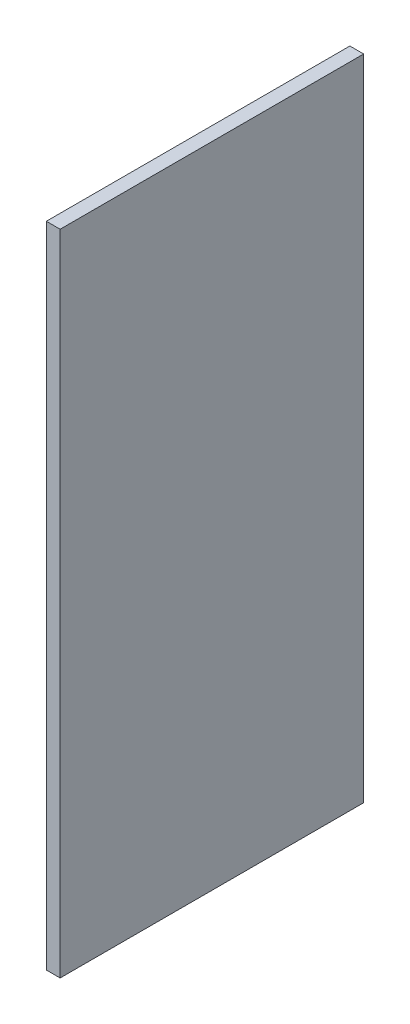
ISO-10303-21;
HEADER;
FILE_DESCRIPTION(('STEP AP214'),'2;1');
FILE_NAME('part.step','',(''),(''),'','','');
FILE_SCHEMA(('AUTOMOTIVE_DESIGN { 1 0 10303 214 1 1 1 1 }'));
ENDSEC;
DATA;
#1=APPLICATION_CONTEXT('core data for automotive mechanical design processes');
#2=APPLICATION_PROTOCOL_DEFINITION('international standard','automotive_design',2000,#1);
#3=PRODUCT_CONTEXT('',#1,'mechanical');
#4=PRODUCT('Part','Part','',(#3));
#5=PRODUCT_RELATED_PRODUCT_CATEGORY('part','',(#4));
#6=PRODUCT_DEFINITION_FORMATION('','',#4);
#7=PRODUCT_DEFINITION_CONTEXT('part definition',#1,'design');
#8=PRODUCT_DEFINITION('design','',#6,#7);
#9=PRODUCT_DEFINITION_SHAPE('','',#8);
#10=(LENGTH_UNIT() NAMED_UNIT(*) SI_UNIT(.MILLI.,.METRE.));
#11=(NAMED_UNIT(*) PLANE_ANGLE_UNIT() SI_UNIT($,.RADIAN.));
#12=(NAMED_UNIT(*) SI_UNIT($,.STERADIAN.) SOLID_ANGLE_UNIT());
#13=UNCERTAINTY_MEASURE_WITH_UNIT(LENGTH_MEASURE(1.E-05),#10,'distance_accuracy_value','');
#14=(GEOMETRIC_REPRESENTATION_CONTEXT(3) GLOBAL_UNCERTAINTY_ASSIGNED_CONTEXT((#13)) GLOBAL_UNIT_ASSIGNED_CONTEXT((#10,
#11,#12)) REPRESENTATION_CONTEXT('',''));
#15=CARTESIAN_POINT('',(0.,0.,0.));
#16=DIRECTION('',(0.,0.,1.));
#17=DIRECTION('',(1.,0.,0.));
#18=AXIS2_PLACEMENT_3D('',#15,#16,#17);
#19=CARTESIAN_POINT('',(-31.7831881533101,63.5663763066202,110.));
#20=DIRECTION('',(1.,0.,0.));
#21=DIRECTION('',(0.,1.,0.));
#22=AXIS2_PLACEMENT_3D('',#19,#20,#21);
#23=PLANE('',#22);
#24=DIRECTION('',(0.,-1.,0.));
#25=VECTOR('',#24,1.);
#26=CARTESIAN_POINT('',(-31.7831881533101,63.5663763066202,0.));
#27=LINE('',#26,#25);
#28=CARTESIAN_POINT('',(-31.7831881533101,63.5663763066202,0.));
#29=VERTEX_POINT('',#28);
#30=CARTESIAN_POINT('',(-31.7831881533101,-171.43362369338,0.));
#31=VERTEX_POINT('',#30);
#32=EDGE_CURVE('E79',#29,#31,#27,.T.);
#33=ORIENTED_EDGE('',*,*,#32,.T.);
#34=DIRECTION('',(0.,0.,-1.));
#35=VECTOR('',#34,1.);
#36=CARTESIAN_POINT('',(-31.7831881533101,-171.43362369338,110.));
#37=LINE('',#36,#35);
#38=CARTESIAN_POINT('',(-31.7831881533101,-171.43362369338,110.));
#39=VERTEX_POINT('',#38);
#40=EDGE_CURVE('E11',#39,#31,#37,.T.);
#41=ORIENTED_EDGE('',*,*,#40,.F.);
#42=DIRECTION('',(0.,-1.,0.));
#43=VECTOR('',#42,1.);
#44=CARTESIAN_POINT('',(-31.7831881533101,63.5663763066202,110.));
#45=LINE('',#44,#43);
#46=CARTESIAN_POINT('',(-31.7831881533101,63.5663763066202,110.));
#47=VERTEX_POINT('',#46);
#48=EDGE_CURVE('E97',#47,#39,#45,.T.);
#49=ORIENTED_EDGE('',*,*,#48,.F.);
#50=DIRECTION('',(0.,0.,-1.));
#51=VECTOR('',#50,1.);
#52=CARTESIAN_POINT('',(-31.7831881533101,63.5663763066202,110.));
#53=LINE('',#52,#51);
#54=EDGE_CURVE('E91',#47,#29,#53,.T.);
#55=ORIENTED_EDGE('',*,*,#54,.T.);
#56=EDGE_LOOP('',(#33,#41,#49,#55));
#57=FACE_BOUND('',#56,.T.);
#58=ADVANCED_FACE('F35',(#57),#23,.F.);
#59=CARTESIAN_POINT('',(-31.7831881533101,-171.43362369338,110.));
#60=DIRECTION('',(0.,1.,0.));
#61=DIRECTION('',(0.,0.,1.));
#62=AXIS2_PLACEMENT_3D('',#59,#60,#61);
#63=PLANE('',#62);
#64=DIRECTION('',(1.,0.,0.));
#65=VECTOR('',#64,1.);
#66=CARTESIAN_POINT('',(-31.7831881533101,-171.43362369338,0.));
#67=LINE('',#66,#65);
#68=CARTESIAN_POINT('',(-26.7831881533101,-171.43362369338,0.));
#69=VERTEX_POINT('',#68);
#70=EDGE_CURVE('E75',#31,#69,#67,.T.);
#71=ORIENTED_EDGE('',*,*,#70,.T.);
#72=DIRECTION('',(0.,0.,-1.));
#73=VECTOR('',#72,1.);
#74=CARTESIAN_POINT('',(-26.7831881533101,-171.43362369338,110.));
#75=LINE('',#74,#73);
#76=CARTESIAN_POINT('',(-26.7831881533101,-171.43362369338,110.));
#77=VERTEX_POINT('',#76);
#78=EDGE_CURVE('E42',#77,#69,#75,.T.);
#79=ORIENTED_EDGE('',*,*,#78,.F.);
#80=DIRECTION('',(1.,0.,0.));
#81=VECTOR('',#80,1.);
#82=CARTESIAN_POINT('',(-31.7831881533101,-171.43362369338,110.));
#83=LINE('',#82,#81);
#84=EDGE_CURVE('E87',#39,#77,#83,.T.);
#85=ORIENTED_EDGE('',*,*,#84,.F.);
#86=ORIENTED_EDGE('',*,*,#40,.T.);
#87=EDGE_LOOP('',(#71,#79,#85,#86));
#88=FACE_BOUND('',#87,.T.);
#89=ADVANCED_FACE('F86',(#88),#63,.F.);
#90=CARTESIAN_POINT('',(-26.7831881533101,63.5663763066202,110.));
#91=DIRECTION('',(-1.,0.,0.));
#92=DIRECTION('',(0.,-1.,0.));
#93=AXIS2_PLACEMENT_3D('',#90,#91,#92);
#94=PLANE('',#93);
#95=DIRECTION('',(0.,1.,0.));
#96=VECTOR('',#95,1.);
#97=CARTESIAN_POINT('',(-26.7831881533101,63.5663763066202,0.));
#98=LINE('',#97,#96);
#99=CARTESIAN_POINT('',(-26.7831881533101,63.5663763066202,0.));
#100=VERTEX_POINT('',#99);
#101=EDGE_CURVE('E80',#69,#100,#98,.T.);
#102=ORIENTED_EDGE('',*,*,#101,.T.);
#103=DIRECTION('',(0.,0.,-1.));
#104=VECTOR('',#103,1.);
#105=CARTESIAN_POINT('',(-26.7831881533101,63.5663763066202,110.));
#106=LINE('',#105,#104);
#107=CARTESIAN_POINT('',(-26.7831881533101,63.5663763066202,110.));
#108=VERTEX_POINT('',#107);
#109=EDGE_CURVE('E103',#108,#100,#106,.T.);
#110=ORIENTED_EDGE('',*,*,#109,.F.);
#111=DIRECTION('',(0.,1.,0.));
#112=VECTOR('',#111,1.);
#113=CARTESIAN_POINT('',(-26.7831881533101,63.5663763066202,110.));
#114=LINE('',#113,#112);
#115=EDGE_CURVE('E54',#77,#108,#114,.T.);
#116=ORIENTED_EDGE('',*,*,#115,.F.);
#117=ORIENTED_EDGE('',*,*,#78,.T.);
#118=EDGE_LOOP('',(#102,#110,#116,#117));
#119=FACE_BOUND('',#118,.T.);
#120=ADVANCED_FACE('F106',(#119),#94,.F.);
#121=CARTESIAN_POINT('',(-31.7831881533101,63.5663763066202,110.));
#122=DIRECTION('',(0.,-1.,0.));
#123=DIRECTION('',(0.,0.,-1.));
#124=AXIS2_PLACEMENT_3D('',#121,#122,#123);
#125=PLANE('',#124);
#126=DIRECTION('',(-1.,0.,0.));
#127=VECTOR('',#126,1.);
#128=CARTESIAN_POINT('',(-31.7831881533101,63.5663763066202,0.));
#129=LINE('',#128,#127);
#130=EDGE_CURVE('E95',#100,#29,#129,.T.);
#131=ORIENTED_EDGE('',*,*,#130,.T.);
#132=ORIENTED_EDGE('',*,*,#54,.F.);
#133=DIRECTION('',(-1.,0.,0.));
#134=VECTOR('',#133,1.);
#135=CARTESIAN_POINT('',(-31.7831881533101,63.5663763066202,110.));
#136=LINE('',#135,#134);
#137=EDGE_CURVE('E49',#108,#47,#136,.T.);
#138=ORIENTED_EDGE('',*,*,#137,.F.);
#139=ORIENTED_EDGE('',*,*,#109,.T.);
#140=EDGE_LOOP('',(#131,#132,#138,#139));
#141=FACE_BOUND('',#140,.T.);
#142=ADVANCED_FACE('F108',(#141),#125,.F.);
#143=CARTESIAN_POINT('',(-31.7831881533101,-171.43362369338,110.));
#144=DIRECTION('',(0.,0.,1.));
#145=DIRECTION('',(1.,0.,0.));
#146=AXIS2_PLACEMENT_3D('',#143,#144,#145);
#147=PLANE('',#146);
#148=ORIENTED_EDGE('',*,*,#48,.T.);
#149=ORIENTED_EDGE('',*,*,#84,.T.);
#150=ORIENTED_EDGE('',*,*,#115,.T.);
#151=ORIENTED_EDGE('',*,*,#137,.T.);
#152=EDGE_LOOP('',(#148,#149,#150,#151));
#153=FACE_BOUND('',#152,.T.);
#154=ADVANCED_FACE('F109',(#153),#147,.T.);
#155=CARTESIAN_POINT('',(-31.7831881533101,-171.43362369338,0.));
#156=DIRECTION('',(0.,0.,1.));
#157=DIRECTION('',(1.,0.,0.));
#158=AXIS2_PLACEMENT_3D('',#155,#156,#157);
#159=PLANE('',#158);
#160=ORIENTED_EDGE('',*,*,#32,.F.);
#161=ORIENTED_EDGE('',*,*,#130,.F.);
#162=ORIENTED_EDGE('',*,*,#101,.F.);
#163=ORIENTED_EDGE('',*,*,#70,.F.);
#164=EDGE_LOOP('',(#160,#161,#162,#163));
#165=FACE_BOUND('',#164,.T.);
#166=ADVANCED_FACE('F76',(#165),#159,.F.);
#167=CLOSED_SHELL('',(#58,#89,#120,#142,#154,#166));
#168=MANIFOLD_SOLID_BREP('B2',#167);
#169=ADVANCED_BREP_SHAPE_REPRESENTATION('',(#18,#168),#14);
#170=SHAPE_DEFINITION_REPRESENTATION(#9,#169);
ENDSEC;
END-ISO-10303-21;
